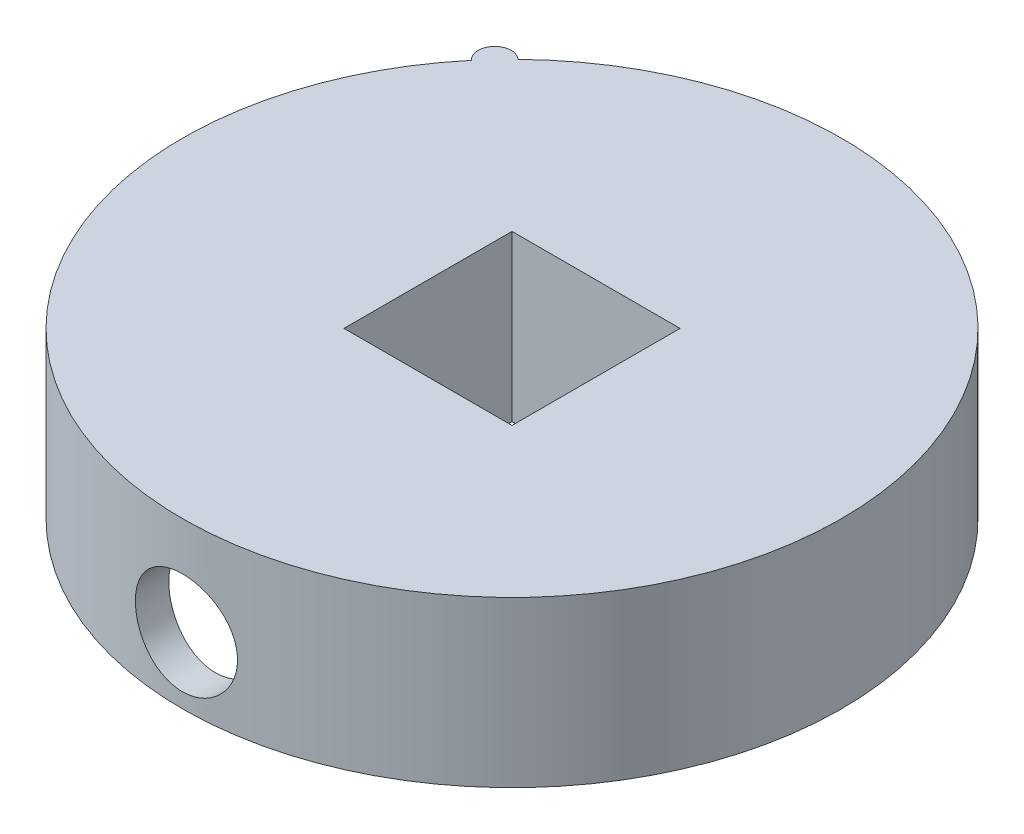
from build123d import *

# Parameters (mm, degrees)
SKETCH1_R           = 20
BOSS_EXTRUDE1_DEPTH = 10
SKETCH2_W           = 10.2
SKETCH2_H           = 10.2
CUT_EXTRUDE2_DEPTH  = 31
SHELL3_T            = -2
SKETCH3_R           = 3.1
CUT_EXTRUDE3_DEPTH  = 36.134171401
BOSS_EXTRUDE2_DEPTH = 10


with BuildPart() as part:
    # Sketch1 → Boss-Extrude1 (new body)
    with BuildSketch(Plane(origin=(0, 0, 0), x_dir=(1, 0, 0), z_dir=(0, 1, 0))):
        with Locations(Location((0, 0, 0), (0, 0, 270))):
            Circle(SKETCH1_R)
    extrude(amount=BOSS_EXTRUDE1_DEPTH)

    # Sketch2 → Cut-Extrude2 (cut, through all)
    with BuildSketch(Plane.XZ):
        Rectangle(SKETCH2_W, SKETCH2_H)
    extrude(amount=-CUT_EXTRUDE2_DEPTH, mode=Mode.SUBTRACT)

    # Shell3
    shell3_openings = [part.faces().sort_by_distance(p)[0] for p in [
        (0, 0, -19.434314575),
    ]]
    offset(amount=SHELL3_T, openings=shell3_openings, kind=Kind.INTERSECTION)

    # Sketch3 → Cut-Extrude3 (cut, through all)
    with BuildSketch(Plane.XY.offset(7.1)):
        with Locations(Location((0, 4, 0), (0, 0, 90.000000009))):
            Circle(SKETCH3_R)
    extrude(amount=CUT_EXTRUDE3_DEPTH, mode=Mode.SUBTRACT)

    # Sketch4 → Boss-Extrude2 (add)
    with BuildSketch(Plane(origin=(0, 10, 0), x_dir=(1, 0, 0), z_dir=(0, 1, 0))):
        with BuildLine():
            Line((-13.960317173, 14.321646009), (-15.320888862, 12.855752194))
            ThreePointArc((-15.320888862, 12.855752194), (-15.373549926, 14.268984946), (-13.960317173, 14.321646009))
        make_face()
    extrude(amount=-BOSS_EXTRUDE2_DEPTH)


solid = part.part
